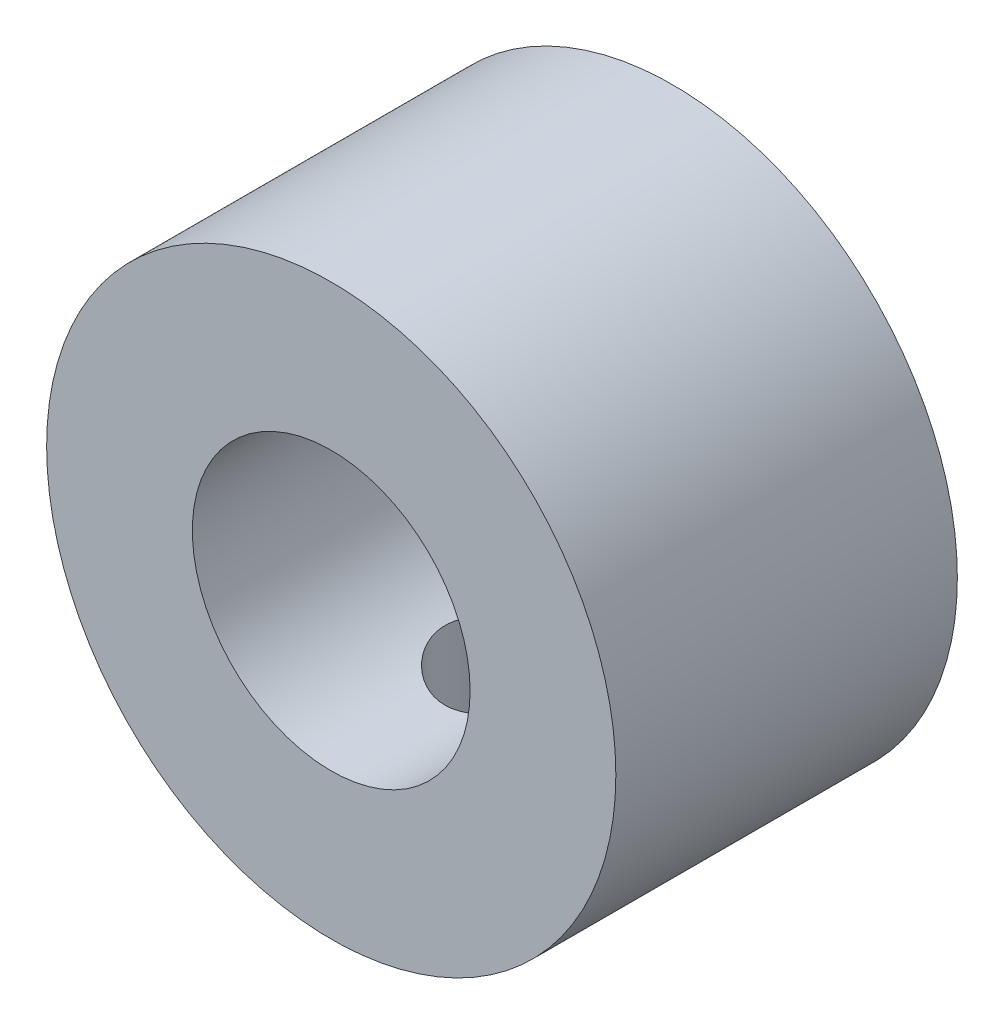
from build123d import *

# Parameters (mm, degrees)
ESQUISSE1_R                = 12.5
ESQUISSE1_R_2              = 6.1
EXTRU_MINCE1_DEPTH         = 7.5
TROU_TARAUD_M6X1_02_REACH  = 30.94
TROU_TARAUD_M6X1_02_BORE_R = 2.5


with BuildPart() as part:
    # Esquisse1 → Extru.-Mince1 (new, symmetric)
    with BuildSketch(Plane.XY):
        Circle(ESQUISSE1_R)
        Circle(ESQUISSE1_R_2, mode=Mode.SUBTRACT)
    extrude(amount=EXTRU_MINCE1_DEPTH, both=True)

    # Trou taraud_ M6x1.02 bore (on position points) → Trou taraud_ M6x1.02 (cut, up to next)
    with BuildSketch(Plane(origin=(0, -12.5, 0), x_dir=(-1, 0, 0), z_dir=(0, -1, 0)), mode=Mode.PRIVATE) as trou_taraud_m6x1_02_sk1:
        Circle(TROU_TARAUD_M6X1_02_BORE_R)
    trou_taraud_m6x1_02_tool1 = extrude(trou_taraud_m6x1_02_sk1.sketch, amount=-TROU_TARAUD_M6X1_02_REACH, mode=Mode.PRIVATE) & part.part
    add(trou_taraud_m6x1_02_tool1.solids().sort_by_distance((0, -12.5, 0))[0], mode=Mode.SUBTRACT)


solid = part.part
